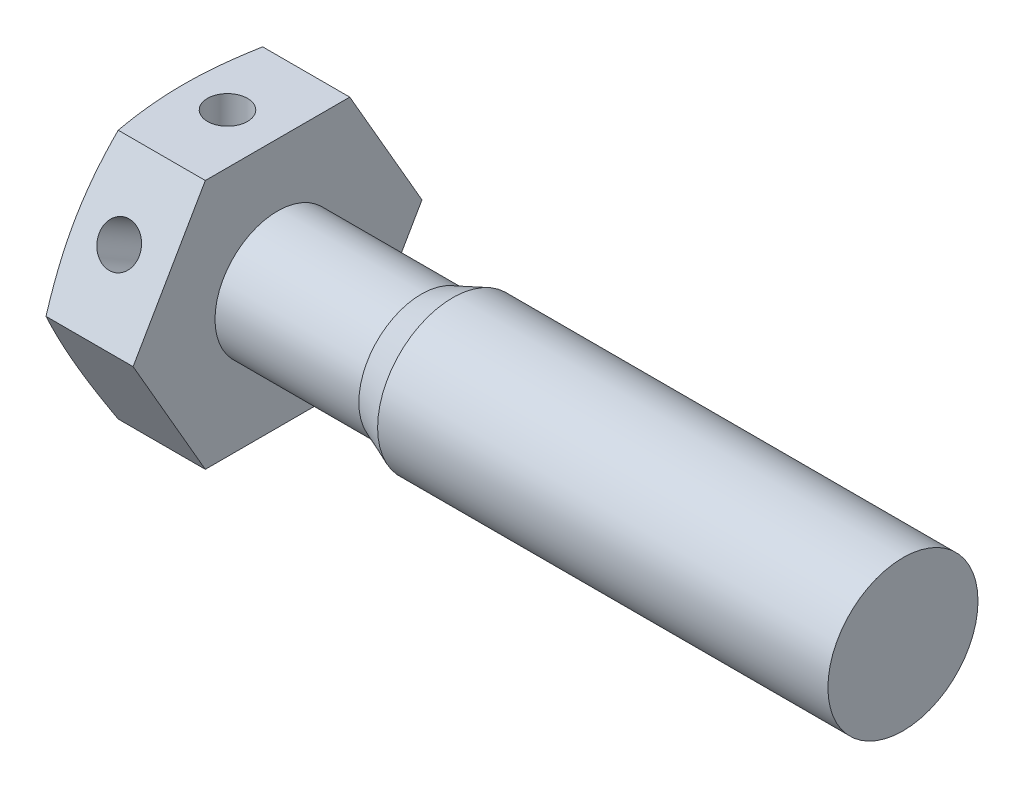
ISO-10303-21;
HEADER;
FILE_DESCRIPTION(('STEP AP214'),'2;1');
FILE_NAME('part.step','',(''),(''),'','','');
FILE_SCHEMA(('AUTOMOTIVE_DESIGN { 1 0 10303 214 1 1 1 1 }'));
ENDSEC;
DATA;
#1=APPLICATION_CONTEXT('core data for automotive mechanical design processes');
#2=APPLICATION_PROTOCOL_DEFINITION('international standard','automotive_design',2000,#1);
#3=PRODUCT_CONTEXT('',#1,'mechanical');
#4=PRODUCT('Part','Part','',(#3));
#5=PRODUCT_RELATED_PRODUCT_CATEGORY('part','',(#4));
#6=PRODUCT_DEFINITION_FORMATION('','',#4);
#7=PRODUCT_DEFINITION_CONTEXT('part definition',#1,'design');
#8=PRODUCT_DEFINITION('design','',#6,#7);
#9=PRODUCT_DEFINITION_SHAPE('','',#8);
#10=(LENGTH_UNIT() NAMED_UNIT(*) SI_UNIT(.MILLI.,.METRE.));
#11=(NAMED_UNIT(*) PLANE_ANGLE_UNIT() SI_UNIT($,.RADIAN.));
#12=(NAMED_UNIT(*) SI_UNIT($,.STERADIAN.) SOLID_ANGLE_UNIT());
#13=UNCERTAINTY_MEASURE_WITH_UNIT(LENGTH_MEASURE(1.E-05),#10,'distance_accuracy_value','');
#14=(GEOMETRIC_REPRESENTATION_CONTEXT(3) GLOBAL_UNCERTAINTY_ASSIGNED_CONTEXT((#13)) GLOBAL_UNIT_ASSIGNED_CONTEXT((#10,
#11,#12)) REPRESENTATION_CONTEXT('',''));
#15=CARTESIAN_POINT('',(0.,0.,0.));
#16=DIRECTION('',(0.,0.,1.));
#17=DIRECTION('',(1.,0.,0.));
#18=AXIS2_PLACEMENT_3D('',#15,#16,#17);
#19=CARTESIAN_POINT('',(2.,-5.,0.));
#20=DIRECTION('',(0.,1.,0.));
#21=DIRECTION('',(0.,0.,1.));
#22=AXIS2_PLACEMENT_3D('',#19,#20,#21);
#23=CYLINDRICAL_SURFACE('',#22,0.8);
#24=CARTESIAN_POINT('',(2.,5.00000000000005,0.));
#25=DIRECTION('',(0.,1.,0.));
#26=DIRECTION('',(0.,0.,1.));
#27=AXIS2_PLACEMENT_3D('',#24,#25,#26);
#28=CIRCLE('',#27,0.8);
#29=CARTESIAN_POINT('',(2.,5.00000000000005,0.8));
#30=VERTEX_POINT('',#29);
#31=EDGE_CURVE('E321',#30,#30,#28,.T.);
#32=ORIENTED_EDGE('',*,*,#31,.T.);
#33=EDGE_LOOP('',(#32));
#34=FACE_BOUND('',#33,.T.);
#35=CARTESIAN_POINT('',(2.,0.,0.));
#36=DIRECTION('',(0.,0.500000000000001,-0.866025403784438));
#37=DIRECTION('',(0.,0.866025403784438,0.500000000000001));
#38=AXIS2_PLACEMENT_3D('',#35,#36,#37);
#39=ELLIPSE('',#38,1.6,0.8);
#40=CARTESIAN_POINT('',(2.8,0.,0.));
#41=VERTEX_POINT('',#40);
#42=CARTESIAN_POINT('',(1.2,0.,0.));
#43=VERTEX_POINT('',#42);
#44=EDGE_CURVE('E51',#41,#43,#39,.F.);
#45=ORIENTED_EDGE('',*,*,#44,.T.);
#46=CARTESIAN_POINT('',(2.,0.,0.));
#47=DIRECTION('',(0.,0.866025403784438,0.500000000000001));
#48=DIRECTION('',(0.,0.500000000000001,-0.866025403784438));
#49=AXIS2_PLACEMENT_3D('',#46,#47,#48);
#50=ELLIPSE('',#49,0.923760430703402,0.8);
#51=EDGE_CURVE('E11',#43,#41,#50,.F.);
#52=ORIENTED_EDGE('',*,*,#51,.T.);
#53=EDGE_LOOP('',(#45,#52));
#54=FACE_BOUND('',#53,.T.);
#55=ADVANCED_FACE('F37',(#34,#54),#23,.F.);
#56=CARTESIAN_POINT('',(4.,-5.,-2.88675134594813));
#57=DIRECTION('',(0.,0.5,0.866025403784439));
#58=DIRECTION('',(0.,-0.866025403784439,0.5));
#59=AXIS2_PLACEMENT_3D('',#56,#57,#58);
#60=PLANE('',#59);
#61=CARTESIAN_POINT('',(2.,-2.49999999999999,-4.3301270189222));
#62=DIRECTION('',(0.,0.5,0.866025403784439));
#63=DIRECTION('',(0.,-0.866025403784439,0.5));
#64=AXIS2_PLACEMENT_3D('',#61,#62,#63);
#65=CIRCLE('',#64,0.8);
#66=CARTESIAN_POINT('',(2.,-3.19282032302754,-3.9301270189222));
#67=VERTEX_POINT('',#66);
#68=EDGE_CURVE('E325',#67,#67,#65,.T.);
#69=ORIENTED_EDGE('',*,*,#68,.T.);
#70=EDGE_LOOP('',(#69));
#71=FACE_BOUND('',#70,.T.);
#72=CARTESIAN_POINT('',(0.518154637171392,0.00019999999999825,-5.7736181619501));
#73=CARTESIAN_POINT('',(0.47462281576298,-0.206877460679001,-5.65406193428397));
#74=CARTESIAN_POINT('',(0.435023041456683,-0.41463778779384,-5.5341114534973));
#75=CARTESIAN_POINT('',(0.365353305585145,-0.831509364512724,-5.29343053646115));
#76=CARTESIAN_POINT('',(0.335290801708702,-1.04062154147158,-5.17269956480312));
#77=CARTESIAN_POINT('',(0.286665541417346,-1.45787607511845,-4.93179754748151));
#78=CARTESIAN_POINT('',(0.267996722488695,-1.66600890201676,-4.81163200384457));
#79=CARTESIAN_POINT('',(0.242956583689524,-2.08276129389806,-4.57101989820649));
#80=CARTESIAN_POINT('',(0.236580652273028,-2.29138064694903,-4.45057345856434));
#81=CARTESIAN_POINT('',(0.236580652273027,-2.70861935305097,-4.20968057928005));
#82=CARTESIAN_POINT('',(0.242956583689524,-2.91723870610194,-4.08923413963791));
#83=CARTESIAN_POINT('',(0.267996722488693,-3.33399109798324,-3.84862203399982));
#84=CARTESIAN_POINT('',(0.286665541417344,-3.54212392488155,-3.72845649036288));
#85=CARTESIAN_POINT('',(0.335290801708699,-3.95937845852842,-3.48755447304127));
#86=CARTESIAN_POINT('',(0.365353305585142,-4.16849063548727,-3.36682350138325));
#87=CARTESIAN_POINT('',(0.435023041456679,-4.58536221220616,-3.1261425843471));
#88=CARTESIAN_POINT('',(0.474622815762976,-4.793122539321,-3.00619210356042));
#89=CARTESIAN_POINT('',(0.518154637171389,-5.0002,-2.8866358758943));
#90=B_SPLINE_CURVE_WITH_KNOTS('',3,(#72,#73,#74,#75,#76,#77,#78,#79,#80,#81,#82,#83,#84,#85,#86,
#87,#88,#89),.UNSPECIFIED.,.F.,.F.,(4,2,2,2,2,2,2,2,4),(0.,0.729203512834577,1.45897583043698,
2.18184682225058,2.90444658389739,3.6270463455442,4.34991733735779,5.0796896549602,
5.80889316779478),.UNSPECIFIED.);
#91=CARTESIAN_POINT('',(0.518112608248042,0.,-5.77350269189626));
#92=VERTEX_POINT('',#91);
#93=CARTESIAN_POINT('',(0.518112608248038,-5.,-2.88675134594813));
#94=VERTEX_POINT('',#93);
#95=EDGE_CURVE('E59',#92,#94,#90,.T.);
#96=ORIENTED_EDGE('',*,*,#95,.F.);
#97=DIRECTION('',(-1.,0.,0.));
#98=VECTOR('',#97,1.);
#99=CARTESIAN_POINT('',(4.,0.,-5.77350269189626));
#100=LINE('',#99,#98);
#101=CARTESIAN_POINT('',(4.,0.,-5.77350269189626));
#102=VERTEX_POINT('',#101);
#103=EDGE_CURVE('E106',#102,#92,#100,.T.);
#104=ORIENTED_EDGE('',*,*,#103,.F.);
#105=DIRECTION('',(0.,0.866025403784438,-0.5));
#106=VECTOR('',#105,1.);
#107=CARTESIAN_POINT('',(4.,-5.,-2.88675134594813));
#108=LINE('',#107,#106);
#109=CARTESIAN_POINT('',(4.,-5.,-2.88675134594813));
#110=VERTEX_POINT('',#109);
#111=EDGE_CURVE('E138',#110,#102,#108,.T.);
#112=ORIENTED_EDGE('',*,*,#111,.F.);
#113=DIRECTION('',(-1.,0.,0.));
#114=VECTOR('',#113,1.);
#115=CARTESIAN_POINT('',(4.,-5.,-2.88675134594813));
#116=LINE('',#115,#114);
#117=EDGE_CURVE('E125',#110,#94,#116,.T.);
#118=ORIENTED_EDGE('',*,*,#117,.T.);
#119=EDGE_LOOP('',(#96,#104,#112,#118));
#120=FACE_BOUND('',#119,.T.);
#121=ADVANCED_FACE('F39',(#71,#120),#60,.F.);
#122=CARTESIAN_POINT('',(4.,0.,-5.77350269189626));
#123=DIRECTION('',(0.,-0.500000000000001,0.866025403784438));
#124=DIRECTION('',(0.,-0.866025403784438,-0.500000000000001));
#125=AXIS2_PLACEMENT_3D('',#122,#123,#124);
#126=PLANE('',#125);
#127=CARTESIAN_POINT('',(0.518154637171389,5.0002,-2.88663587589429));
#128=CARTESIAN_POINT('',(0.474622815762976,4.793122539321,-3.00619210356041));
#129=CARTESIAN_POINT('',(0.435023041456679,4.58536221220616,-3.12614258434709));
#130=CARTESIAN_POINT('',(0.365353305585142,4.16849063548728,-3.36682350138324));
#131=CARTESIAN_POINT('',(0.335290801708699,3.95937845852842,-3.48755447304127));
#132=CARTESIAN_POINT('',(0.286665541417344,3.54212392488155,-3.72845649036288));
#133=CARTESIAN_POINT('',(0.267996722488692,3.33399109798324,-3.84862203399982));
#134=CARTESIAN_POINT('',(0.242956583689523,2.91723870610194,-4.0892341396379));
#135=CARTESIAN_POINT('',(0.236580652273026,2.70861935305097,-4.20968057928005));
#136=CARTESIAN_POINT('',(0.236580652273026,2.29138064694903,-4.45057345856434));
#137=CARTESIAN_POINT('',(0.242956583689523,2.08276129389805,-4.57101989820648));
#138=CARTESIAN_POINT('',(0.267996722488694,1.66600890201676,-4.81163200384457));
#139=CARTESIAN_POINT('',(0.286665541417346,1.45787607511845,-4.93179754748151));
#140=CARTESIAN_POINT('',(0.335290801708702,1.04062154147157,-5.17269956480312));
#141=CARTESIAN_POINT('',(0.365353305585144,0.831509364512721,-5.29343053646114));
#142=CARTESIAN_POINT('',(0.435023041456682,0.414637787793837,-5.5341114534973));
#143=CARTESIAN_POINT('',(0.47462281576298,0.206877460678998,-5.65406193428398));
#144=CARTESIAN_POINT('',(0.518154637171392,-0.000200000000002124,-5.7736181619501));
#145=B_SPLINE_CURVE_WITH_KNOTS('',3,(#127,#128,#129,#130,#131,#132,#133,#134,#135,#136,#137,
#138,#139,#140,#141,#142,#143,#144),.UNSPECIFIED.,.F.,.F.,(4,2,2,2,2,2,2,2,4),(0.,
0.729203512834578,1.45897583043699,2.18184682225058,2.90444658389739,3.6270463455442,
4.3499173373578,5.07968965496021,5.80889316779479),.UNSPECIFIED.);
#146=CARTESIAN_POINT('',(0.518112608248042,5.,-2.88675134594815));
#147=VERTEX_POINT('',#146);
#148=EDGE_CURVE('E149',#147,#92,#145,.T.);
#149=ORIENTED_EDGE('',*,*,#148,.F.);
#150=DIRECTION('',(-1.,0.,0.));
#151=VECTOR('',#150,1.);
#152=CARTESIAN_POINT('',(4.,5.,-2.88675134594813));
#153=LINE('',#152,#151);
#154=CARTESIAN_POINT('',(4.,5.,-2.88675134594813));
#155=VERTEX_POINT('',#154);
#156=EDGE_CURVE('E113',#155,#147,#153,.T.);
#157=ORIENTED_EDGE('',*,*,#156,.F.);
#158=DIRECTION('',(0.,0.866025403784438,0.5));
#159=VECTOR('',#158,1.);
#160=CARTESIAN_POINT('',(4.,0.,-5.77350269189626));
#161=LINE('',#160,#159);
#162=EDGE_CURVE('E136',#102,#155,#161,.T.);
#163=ORIENTED_EDGE('',*,*,#162,.F.);
#164=ORIENTED_EDGE('',*,*,#103,.T.);
#165=EDGE_LOOP('',(#149,#157,#163,#164));
#166=FACE_BOUND('',#165,.T.);
#167=ADVANCED_FACE('F204',(#166),#126,.F.);
#168=CARTESIAN_POINT('',(4.,5.,-2.88675134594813));
#169=DIRECTION('',(0.,-1.,0.));
#170=DIRECTION('',(0.,0.,-1.));
#171=AXIS2_PLACEMENT_3D('',#168,#169,#170);
#172=PLANE('',#171);
#173=ORIENTED_EDGE('',*,*,#31,.F.);
#174=EDGE_LOOP('',(#173));
#175=FACE_BOUND('',#174,.T.);
#176=CARTESIAN_POINT('',(1.73412088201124,5.,-7.62058685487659));
#177=CARTESIAN_POINT('',(1.66536818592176,5.,-7.39459725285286));
#178=CARTESIAN_POINT('',(1.5974227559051,5.,-7.16835746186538));
#179=CARTESIAN_POINT('',(1.46359308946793,5.,-6.71525017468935));
#180=CARTESIAN_POINT('',(1.39770901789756,5.,-6.48838262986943));
#181=CARTESIAN_POINT('',(1.26833776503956,5.,-6.03349928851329));
#182=CARTESIAN_POINT('',(1.20485534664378,5.,-5.80548213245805));
#183=CARTESIAN_POINT('',(1.08103648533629,5.,-5.34859642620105));
#184=CARTESIAN_POINT('',(1.02069998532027,5.,-5.11972789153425));
#185=CARTESIAN_POINT('',(0.904681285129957,5.,-4.66385371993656));
#186=CARTESIAN_POINT('',(0.848950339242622,5.,-4.43686055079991));
#187=CARTESIAN_POINT('',(0.742270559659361,5.,-3.98175526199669));
#188=CARTESIAN_POINT('',(0.691321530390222,5.,-3.7536431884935));
#189=CARTESIAN_POINT('',(0.595395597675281,5.,-3.29623351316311));
#190=CARTESIAN_POINT('',(0.550416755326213,5.,-3.06693632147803));
#191=CARTESIAN_POINT('',(0.467808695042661,5.,-2.60701194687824));
#192=CARTESIAN_POINT('',(0.430179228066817,5.,-2.37638480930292));
#193=CARTESIAN_POINT('',(0.367531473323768,5.,-1.93980954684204));
#194=CARTESIAN_POINT('',(0.341571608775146,5.,-1.73399780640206));
#195=CARTESIAN_POINT('',(0.297702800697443,5.,-1.32151095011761));
#196=CARTESIAN_POINT('',(0.279793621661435,5.,-1.11483585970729));
#197=CARTESIAN_POINT('',(0.252888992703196,5.,-0.70104199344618));
#198=CARTESIAN_POINT('',(0.243887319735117,5.,-0.49392362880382));
#199=CARTESIAN_POINT('',(0.235252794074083,5.,-0.0794895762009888));
#200=CARTESIAN_POINT('',(0.235619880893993,5.,0.127826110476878));
#201=CARTESIAN_POINT('',(0.245728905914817,5.,0.543296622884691));
#202=CARTESIAN_POINT('',(0.255519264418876,5.,0.751450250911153));
#203=CARTESIAN_POINT('',(0.284025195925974,5.,1.16714016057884));
#204=CARTESIAN_POINT('',(0.302740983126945,5.,1.37467642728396));
#205=CARTESIAN_POINT('',(0.348227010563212,5.,1.78903168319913));
#206=CARTESIAN_POINT('',(0.375004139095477,5.,1.99584990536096));
#207=CARTESIAN_POINT('',(0.435533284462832,5.,2.40845147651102));
#208=CARTESIAN_POINT('',(0.469285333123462,5.,2.61423482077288));
#209=CARTESIAN_POINT('',(0.544976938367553,5.,3.03762754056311));
#210=CARTESIAN_POINT('',(0.587297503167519,5.,3.25516820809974));
#211=CARTESIAN_POINT('',(0.677388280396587,5.,3.68912540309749));
#212=CARTESIAN_POINT('',(0.725158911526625,5.,3.90554184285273));
#213=CARTESIAN_POINT('',(0.825138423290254,5.,4.33740834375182));
#214=CARTESIAN_POINT('',(0.877348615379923,5.,4.55285809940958));
#215=CARTESIAN_POINT('',(0.985352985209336,5.,4.98284735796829));
#216=CARTESIAN_POINT('',(1.04114707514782,5.,5.19738688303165));
#217=CARTESIAN_POINT('',(1.15571790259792,5.,5.62596240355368));
#218=CARTESIAN_POINT('',(1.21449840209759,5.,5.83999738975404));
#219=CARTESIAN_POINT('',(1.33444153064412,5.,6.26740010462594));
#220=CARTESIAN_POINT('',(1.395604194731,5.,6.48076782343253));
#221=CARTESIAN_POINT('',(1.5819781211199,5.,7.11994374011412));
#222=CARTESIAN_POINT('',(1.71009677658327,5.,7.54490360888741));
#223=CARTESIAN_POINT('',(1.97013168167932,5.,8.38829124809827));
#224=CARTESIAN_POINT('',(2.10198722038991,5.,8.80673789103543));
#225=CARTESIAN_POINT('',(2.3694113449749,5.,9.64246317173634));
#226=CARTESIAN_POINT('',(2.50498011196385,5.,10.0597417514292));
#227=CARTESIAN_POINT('',(2.77829656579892,5.,10.891820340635));
#228=CARTESIAN_POINT('',(2.91603397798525,5.,11.3066237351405));
#229=CARTESIAN_POINT('',(3.19355173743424,5.,12.1355089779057));
#230=CARTESIAN_POINT('',(3.33333191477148,5.,12.5495908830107));
#231=CARTESIAN_POINT('',(3.47382628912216,5.,12.9634270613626));
#232=B_SPLINE_CURVE_WITH_KNOTS('',3,(#176,#177,#178,#179,#180,#181,#182,#183,#184,#185,#186,
#187,#188,#189,#190,#191,#192,#193,#194,#195,#196,#197,#198,#199,#200,#201,#202,#203,#204,#205,
#206,#207,#208,#209,#210,#211,#212,#213,#214,#215,#216,#217,#218,#219,#220,#221,#222,#223,#224,
#225,#226,#227,#228,#229,#230,#231),.UNSPECIFIED.,.F.,.F.,(4,2,2,2,2,2,2,2,2,2,2,2,2,2,2,2,2,2,
2,2,2,2,2,2,2,2,2,4),(0.,0.708654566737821,1.4173656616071,2.1274155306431,2.83745250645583,
3.53861525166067,4.23974930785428,4.94065510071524,5.64153713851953,6.26372739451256,
6.8858994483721,7.50763652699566,8.12936959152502,8.75431450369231,9.37927441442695,
10.0047698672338,10.6302681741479,11.2950391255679,11.9598611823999,12.6248803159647,
13.2898831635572,13.9557455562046,14.6216177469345,15.9531168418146,17.269284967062,
18.585517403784,19.8967329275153,21.2078399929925),.UNSPECIFIED.);
#233=CARTESIAN_POINT('',(0.518112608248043,5.00000000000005,2.8867513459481));
#234=VERTEX_POINT('',#233);
#235=EDGE_CURVE('E194',#234,#147,#232,.F.);
#236=ORIENTED_EDGE('',*,*,#235,.F.);
#237=DIRECTION('',(-1.,0.,0.));
#238=VECTOR('',#237,1.);
#239=CARTESIAN_POINT('',(4.,5.,2.88675134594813));
#240=LINE('',#239,#238);
#241=CARTESIAN_POINT('',(4.,5.,2.88675134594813));
#242=VERTEX_POINT('',#241);
#243=EDGE_CURVE('E116',#242,#234,#240,.T.);
#244=ORIENTED_EDGE('',*,*,#243,.F.);
#245=DIRECTION('',(0.,0.,1.));
#246=VECTOR('',#245,1.);
#247=CARTESIAN_POINT('',(4.,5.,-2.88675134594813));
#248=LINE('',#247,#246);
#249=EDGE_CURVE('E134',#155,#242,#248,.T.);
#250=ORIENTED_EDGE('',*,*,#249,.F.);
#251=ORIENTED_EDGE('',*,*,#156,.T.);
#252=EDGE_LOOP('',(#236,#244,#250,#251));
#253=FACE_BOUND('',#252,.T.);
#254=ADVANCED_FACE('F200',(#175,#253),#172,.F.);
#255=CARTESIAN_POINT('',(4.,5.,2.88675134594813));
#256=DIRECTION('',(0.,-0.5,-0.866025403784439));
#257=DIRECTION('',(0.,0.866025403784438,-0.5));
#258=AXIS2_PLACEMENT_3D('',#255,#256,#257);
#259=PLANE('',#258);
#260=CARTESIAN_POINT('',(2.,2.49999999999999,4.3301270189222));
#261=DIRECTION('',(0.,-0.5,-0.866025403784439));
#262=DIRECTION('',(0.,0.866025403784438,-0.5));
#263=AXIS2_PLACEMENT_3D('',#260,#261,#262);
#264=CIRCLE('',#263,0.8);
#265=CARTESIAN_POINT('',(2.,3.19282032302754,3.9301270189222));
#266=VERTEX_POINT('',#265);
#267=EDGE_CURVE('E328',#266,#266,#264,.T.);
#268=ORIENTED_EDGE('',*,*,#267,.T.);
#269=EDGE_LOOP('',(#268));
#270=FACE_BOUND('',#269,.T.);
#271=CARTESIAN_POINT('',(0.518154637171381,-0.000199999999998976,5.7736181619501));
#272=CARTESIAN_POINT('',(0.474622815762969,0.206877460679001,5.65406193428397));
#273=CARTESIAN_POINT('',(0.435023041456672,0.41463778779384,5.5341114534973));
#274=CARTESIAN_POINT('',(0.365353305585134,0.831509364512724,5.29343053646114));
#275=CARTESIAN_POINT('',(0.335290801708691,1.04062154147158,5.17269956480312));
#276=CARTESIAN_POINT('',(0.286665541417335,1.45787607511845,4.93179754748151));
#277=CARTESIAN_POINT('',(0.267996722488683,1.66600890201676,4.81163200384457));
#278=CARTESIAN_POINT('',(0.242956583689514,2.08276129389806,4.57101989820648));
#279=CARTESIAN_POINT('',(0.236580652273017,2.29138064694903,4.45057345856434));
#280=CARTESIAN_POINT('',(0.236580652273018,2.70861935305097,4.20968057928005));
#281=CARTESIAN_POINT('',(0.242956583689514,2.91723870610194,4.08923413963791));
#282=CARTESIAN_POINT('',(0.267996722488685,3.33399109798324,3.84862203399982));
#283=CARTESIAN_POINT('',(0.286665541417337,3.54212392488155,3.72845649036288));
#284=CARTESIAN_POINT('',(0.335290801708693,3.95937845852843,3.48755447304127));
#285=CARTESIAN_POINT('',(0.365353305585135,4.16849063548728,3.36682350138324));
#286=CARTESIAN_POINT('',(0.435023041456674,4.58536221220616,3.12614258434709));
#287=CARTESIAN_POINT('',(0.474622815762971,4.793122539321,3.00619210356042));
#288=CARTESIAN_POINT('',(0.518154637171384,5.0002,2.88663587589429));
#289=B_SPLINE_CURVE_WITH_KNOTS('',3,(#271,#272,#273,#274,#275,#276,#277,#278,#279,#280,#281,
#282,#283,#284,#285,#286,#287,#288),.UNSPECIFIED.,.F.,.F.,(4,2,2,2,2,2,2,2,4),(0.,
0.729203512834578,1.45897583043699,2.18184682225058,2.90444658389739,3.6270463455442,
4.3499173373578,5.07968965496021,5.80889316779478),.UNSPECIFIED.);
#290=CARTESIAN_POINT('',(0.518112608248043,0.,5.77350269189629));
#291=VERTEX_POINT('',#290);
#292=EDGE_CURVE('E188',#291,#234,#289,.T.);
#293=ORIENTED_EDGE('',*,*,#292,.F.);
#294=DIRECTION('',(-1.,0.,0.));
#295=VECTOR('',#294,1.);
#296=CARTESIAN_POINT('',(4.,0.,5.77350269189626));
#297=LINE('',#296,#295);
#298=CARTESIAN_POINT('',(4.,0.,5.77350269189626));
#299=VERTEX_POINT('',#298);
#300=EDGE_CURVE('E119',#299,#291,#297,.T.);
#301=ORIENTED_EDGE('',*,*,#300,.F.);
#302=DIRECTION('',(0.,-0.866025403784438,0.5));
#303=VECTOR('',#302,1.);
#304=CARTESIAN_POINT('',(4.,5.,2.88675134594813));
#305=LINE('',#304,#303);
#306=EDGE_CURVE('E132',#242,#299,#305,.T.);
#307=ORIENTED_EDGE('',*,*,#306,.F.);
#308=ORIENTED_EDGE('',*,*,#243,.T.);
#309=EDGE_LOOP('',(#293,#301,#307,#308));
#310=FACE_BOUND('',#309,.T.);
#311=ADVANCED_FACE('F203',(#270,#310),#259,.F.);
#312=CARTESIAN_POINT('',(4.,0.,5.77350269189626));
#313=DIRECTION('',(0.,0.500000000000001,-0.866025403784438));
#314=DIRECTION('',(0.,0.866025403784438,0.500000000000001));
#315=AXIS2_PLACEMENT_3D('',#312,#313,#314);
#316=PLANE('',#315);
#317=CARTESIAN_POINT('',(0.518154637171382,-5.0002,2.88663587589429));
#318=CARTESIAN_POINT('',(0.474622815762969,-4.793122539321,3.00619210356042));
#319=CARTESIAN_POINT('',(0.435023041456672,-4.58536221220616,3.12614258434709));
#320=CARTESIAN_POINT('',(0.365353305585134,-4.16849063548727,3.36682350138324));
#321=CARTESIAN_POINT('',(0.335290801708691,-3.95937845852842,3.48755447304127));
#322=CARTESIAN_POINT('',(0.286665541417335,-3.54212392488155,3.72845649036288));
#323=CARTESIAN_POINT('',(0.267996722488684,-3.33399109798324,3.84862203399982));
#324=CARTESIAN_POINT('',(0.242956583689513,-2.91723870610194,4.08923413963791));
#325=CARTESIAN_POINT('',(0.236580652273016,-2.70861935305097,4.20968057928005));
#326=CARTESIAN_POINT('',(0.236580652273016,-2.29138064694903,4.45057345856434));
#327=CARTESIAN_POINT('',(0.242956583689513,-2.08276129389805,4.57101989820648));
#328=CARTESIAN_POINT('',(0.267996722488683,-1.66600890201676,4.81163200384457));
#329=CARTESIAN_POINT('',(0.286665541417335,-1.45787607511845,4.93179754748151));
#330=CARTESIAN_POINT('',(0.335290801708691,-1.04062154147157,5.17269956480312));
#331=CARTESIAN_POINT('',(0.365353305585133,-0.83150936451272,5.29343053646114));
#332=CARTESIAN_POINT('',(0.435023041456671,-0.414637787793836,5.5341114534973));
#333=CARTESIAN_POINT('',(0.474622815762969,-0.206877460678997,5.65406193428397));
#334=CARTESIAN_POINT('',(0.518154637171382,0.000200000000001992,5.7736181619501));
#335=B_SPLINE_CURVE_WITH_KNOTS('',3,(#317,#318,#319,#320,#321,#322,#323,#324,#325,#326,#327,
#328,#329,#330,#331,#332,#333,#334),.UNSPECIFIED.,.F.,.F.,(4,2,2,2,2,2,2,2,4),(0.,
0.729203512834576,1.45897583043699,2.18184682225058,2.90444658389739,3.6270463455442,
4.3499173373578,5.0796896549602,5.80889316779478),.UNSPECIFIED.);
#336=CARTESIAN_POINT('',(0.518112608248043,-4.99999999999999,2.88675134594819));
#337=VERTEX_POINT('',#336);
#338=EDGE_CURVE('E180',#337,#291,#335,.T.);
#339=ORIENTED_EDGE('',*,*,#338,.F.);
#340=DIRECTION('',(-1.,0.,0.));
#341=VECTOR('',#340,1.);
#342=CARTESIAN_POINT('',(4.,-5.,2.88675134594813));
#343=LINE('',#342,#341);
#344=CARTESIAN_POINT('',(4.,-5.,2.88675134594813));
#345=VERTEX_POINT('',#344);
#346=EDGE_CURVE('E122',#345,#337,#343,.T.);
#347=ORIENTED_EDGE('',*,*,#346,.F.);
#348=DIRECTION('',(0.,-0.866025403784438,-0.500000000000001));
#349=VECTOR('',#348,1.);
#350=CARTESIAN_POINT('',(4.,0.,5.77350269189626));
#351=LINE('',#350,#349);
#352=EDGE_CURVE('E130',#299,#345,#351,.T.);
#353=ORIENTED_EDGE('',*,*,#352,.F.);
#354=ORIENTED_EDGE('',*,*,#300,.T.);
#355=EDGE_LOOP('',(#339,#347,#353,#354));
#356=FACE_BOUND('',#355,.T.);
#357=ADVANCED_FACE('F246',(#356),#316,.F.);
#358=CARTESIAN_POINT('',(4.,-5.,2.88675134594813));
#359=DIRECTION('',(0.,1.,0.));
#360=DIRECTION('',(0.,0.,1.));
#361=AXIS2_PLACEMENT_3D('',#358,#359,#360);
#362=PLANE('',#361);
#363=CARTESIAN_POINT('',(2.,-5.,0.));
#364=DIRECTION('',(0.,1.,0.));
#365=DIRECTION('',(0.,0.,1.));
#366=AXIS2_PLACEMENT_3D('',#363,#364,#365);
#367=CIRCLE('',#366,0.8);
#368=CARTESIAN_POINT('',(2.,-5.,0.8));
#369=VERTEX_POINT('',#368);
#370=EDGE_CURVE('E319',#369,#369,#367,.T.);
#371=ORIENTED_EDGE('',*,*,#370,.T.);
#372=EDGE_LOOP('',(#371));
#373=FACE_BOUND('',#372,.T.);
#374=CARTESIAN_POINT('',(1.73412088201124,-5.,-7.6205868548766));
#375=CARTESIAN_POINT('',(1.66536818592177,-5.,-7.39459725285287));
#376=CARTESIAN_POINT('',(1.5974227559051,-5.,-7.16835746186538));
#377=CARTESIAN_POINT('',(1.46359308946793,-5.,-6.71525017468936));
#378=CARTESIAN_POINT('',(1.39770901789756,-5.,-6.48838262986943));
#379=CARTESIAN_POINT('',(1.26833776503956,-5.,-6.03349928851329));
#380=CARTESIAN_POINT('',(1.20485534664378,-5.,-5.80548213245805));
#381=CARTESIAN_POINT('',(1.08103648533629,-5.,-5.34859642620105));
#382=CARTESIAN_POINT('',(1.02069998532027,-5.,-5.11972789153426));
#383=CARTESIAN_POINT('',(0.904681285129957,-5.,-4.66385371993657));
#384=CARTESIAN_POINT('',(0.848950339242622,-5.,-4.43686055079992));
#385=CARTESIAN_POINT('',(0.742270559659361,-5.,-3.9817552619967));
#386=CARTESIAN_POINT('',(0.691321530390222,-5.,-3.7536431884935));
#387=CARTESIAN_POINT('',(0.595395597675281,-5.,-3.29623351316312));
#388=CARTESIAN_POINT('',(0.550416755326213,-5.,-3.06693632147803));
#389=CARTESIAN_POINT('',(0.46780869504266,-5.,-2.60701194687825));
#390=CARTESIAN_POINT('',(0.430179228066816,-5.,-2.37638480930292));
#391=CARTESIAN_POINT('',(0.367531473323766,-5.,-1.93980954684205));
#392=CARTESIAN_POINT('',(0.341571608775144,-5.,-1.73399780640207));
#393=CARTESIAN_POINT('',(0.297702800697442,-5.,-1.32151095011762));
#394=CARTESIAN_POINT('',(0.279793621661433,-5.,-1.11483585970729));
#395=CARTESIAN_POINT('',(0.252888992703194,-5.,-0.701041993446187));
#396=CARTESIAN_POINT('',(0.243887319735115,-5.,-0.493923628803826));
#397=CARTESIAN_POINT('',(0.235252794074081,-5.,-0.0794895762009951));
#398=CARTESIAN_POINT('',(0.235619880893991,-5.,0.127826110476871));
#399=CARTESIAN_POINT('',(0.245728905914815,-5.,0.543296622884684));
#400=CARTESIAN_POINT('',(0.255519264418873,-5.,0.751450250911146));
#401=CARTESIAN_POINT('',(0.284025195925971,-5.,1.16714016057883));
#402=CARTESIAN_POINT('',(0.302740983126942,-5.,1.37467642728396));
#403=CARTESIAN_POINT('',(0.348227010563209,-5.,1.78903168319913));
#404=CARTESIAN_POINT('',(0.375004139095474,-5.,1.99584990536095));
#405=CARTESIAN_POINT('',(0.435533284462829,-5.,2.40845147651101));
#406=CARTESIAN_POINT('',(0.469285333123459,-5.,2.61423482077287));
#407=CARTESIAN_POINT('',(0.54497693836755,-5.,3.0376275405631));
#408=CARTESIAN_POINT('',(0.587297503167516,-5.,3.25516820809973));
#409=CARTESIAN_POINT('',(0.677388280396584,-5.,3.68912540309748));
#410=CARTESIAN_POINT('',(0.725158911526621,-5.,3.90554184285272));
#411=CARTESIAN_POINT('',(0.825138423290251,-5.,4.33740834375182));
#412=CARTESIAN_POINT('',(0.87734861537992,-5.,4.55285809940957));
#413=CARTESIAN_POINT('',(0.985352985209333,-5.,4.98284735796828));
#414=CARTESIAN_POINT('',(1.04114707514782,-5.,5.19738688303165));
#415=CARTESIAN_POINT('',(1.15571790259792,-5.,5.62596240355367));
#416=CARTESIAN_POINT('',(1.21449840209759,-4.99999999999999,5.83999738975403));
#417=CARTESIAN_POINT('',(1.33444153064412,-4.99999999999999,6.26740010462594));
#418=CARTESIAN_POINT('',(1.39560419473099,-4.99999999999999,6.48076782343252));
#419=CARTESIAN_POINT('',(1.5819781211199,-4.99999999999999,7.11994374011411));
#420=CARTESIAN_POINT('',(1.71009677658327,-4.99999999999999,7.5449036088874));
#421=CARTESIAN_POINT('',(1.97013168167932,-4.99999999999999,8.38829124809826));
#422=CARTESIAN_POINT('',(2.10198722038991,-4.99999999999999,8.80673789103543));
#423=CARTESIAN_POINT('',(2.36941134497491,-4.99999999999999,9.64246317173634));
#424=CARTESIAN_POINT('',(2.50498011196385,-4.99999999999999,10.0597417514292));
#425=CARTESIAN_POINT('',(2.77829656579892,-4.99999999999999,10.891820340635));
#426=CARTESIAN_POINT('',(2.91603397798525,-4.99999999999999,11.3066237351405));
#427=CARTESIAN_POINT('',(3.19355173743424,-4.99999999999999,12.1355089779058));
#428=CARTESIAN_POINT('',(3.33333191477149,-4.99999999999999,12.5495908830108));
#429=CARTESIAN_POINT('',(3.47382628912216,-4.99999999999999,12.9634270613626));
#430=B_SPLINE_CURVE_WITH_KNOTS('',3,(#374,#375,#376,#377,#378,#379,#380,#381,#382,#383,#384,
#385,#386,#387,#388,#389,#390,#391,#392,#393,#394,#395,#396,#397,#398,#399,#400,#401,#402,#403,
#404,#405,#406,#407,#408,#409,#410,#411,#412,#413,#414,#415,#416,#417,#418,#419,#420,#421,#422,
#423,#424,#425,#426,#427,#428,#429),.UNSPECIFIED.,.F.,.F.,(4,2,2,2,2,2,2,2,2,2,2,2,2,2,2,2,2,2,
2,2,2,2,2,2,2,2,2,4),(0.,0.708654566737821,1.4173656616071,2.1274155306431,2.83745250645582,
3.53861525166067,4.23974930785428,4.94065510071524,5.64153713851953,6.26372739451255,
6.88589944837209,7.50763652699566,8.12936959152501,8.75431450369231,9.37927441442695,
10.0047698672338,10.6302681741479,11.2950391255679,11.9598611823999,12.6248803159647,
13.2898831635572,13.9557455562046,14.6216177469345,15.9531168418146,17.269284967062,
18.585517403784,19.8967329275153,21.2078399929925),.UNSPECIFIED.);
#431=EDGE_CURVE('E170',#94,#337,#430,.T.);
#432=ORIENTED_EDGE('',*,*,#431,.F.);
#433=ORIENTED_EDGE('',*,*,#117,.F.);
#434=DIRECTION('',(0.,0.,-1.));
#435=VECTOR('',#434,1.);
#436=CARTESIAN_POINT('',(4.,-5.,2.88675134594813));
#437=LINE('',#436,#435);
#438=EDGE_CURVE('E128',#345,#110,#437,.T.);
#439=ORIENTED_EDGE('',*,*,#438,.F.);
#440=ORIENTED_EDGE('',*,*,#346,.T.);
#441=EDGE_LOOP('',(#432,#433,#439,#440));
#442=FACE_BOUND('',#441,.T.);
#443=ADVANCED_FACE('F240',(#373,#442),#362,.F.);
#444=CARTESIAN_POINT('',(4.,0.,-5.77350269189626));
#445=DIRECTION('',(1.,0.,0.));
#446=DIRECTION('',(0.,0.,-1.));
#447=AXIS2_PLACEMENT_3D('',#444,#445,#446);
#448=PLANE('',#447);
#449=ORIENTED_EDGE('',*,*,#438,.T.);
#450=ORIENTED_EDGE('',*,*,#111,.T.);
#451=ORIENTED_EDGE('',*,*,#162,.T.);
#452=ORIENTED_EDGE('',*,*,#249,.T.);
#453=ORIENTED_EDGE('',*,*,#306,.T.);
#454=ORIENTED_EDGE('',*,*,#352,.T.);
#455=EDGE_LOOP('',(#449,#450,#451,#452,#453,#454));
#456=FACE_BOUND('',#455,.T.);
#457=CARTESIAN_POINT('',(4.,0.,0.));
#458=DIRECTION('',(-1.,0.,0.));
#459=DIRECTION('',(0.,0.,1.));
#460=AXIS2_PLACEMENT_3D('',#457,#458,#459);
#461=CIRCLE('',#460,2.5);
#462=CARTESIAN_POINT('',(4.,0.,2.5));
#463=VERTEX_POINT('',#462);
#464=EDGE_CURVE('E277',#463,#463,#461,.T.);
#465=ORIENTED_EDGE('',*,*,#464,.T.);
#466=EDGE_LOOP('',(#465));
#467=FACE_BOUND('',#466,.T.);
#468=ADVANCED_FACE('F161',(#456,#467),#448,.T.);
#469=CARTESIAN_POINT('',(0.,0.,0.));
#470=DIRECTION('',(1.,0.,0.));
#471=DIRECTION('',(0.,0.,-1.));
#472=AXIS2_PLACEMENT_3D('',#469,#470,#471);
#473=CONICAL_SURFACE('',#472,4.35000000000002,1.22173047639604);
#474=CARTESIAN_POINT('',(0.,0.,0.));
#475=DIRECTION('',(-1.,0.,0.));
#476=DIRECTION('',(0.,0.,1.));
#477=AXIS2_PLACEMENT_3D('',#474,#475,#476);
#478=CIRCLE('',#477,4.35000000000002);
#479=CARTESIAN_POINT('',(0.,0.,4.35000000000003));
#480=VERTEX_POINT('',#479);
#481=EDGE_CURVE('E291',#480,#480,#478,.T.);
#482=ORIENTED_EDGE('',*,*,#481,.F.);
#483=EDGE_LOOP('',(#482));
#484=FACE_BOUND('',#483,.T.);
#485=ORIENTED_EDGE('',*,*,#95,.T.);
#486=ORIENTED_EDGE('',*,*,#431,.T.);
#487=ORIENTED_EDGE('',*,*,#338,.T.);
#488=ORIENTED_EDGE('',*,*,#292,.T.);
#489=ORIENTED_EDGE('',*,*,#235,.T.);
#490=ORIENTED_EDGE('',*,*,#148,.T.);
#491=EDGE_LOOP('',(#485,#486,#487,#488,#489,#490));
#492=FACE_BOUND('',#491,.T.);
#493=ADVANCED_FACE('F155',(#484,#492),#473,.T.);
#494=CARTESIAN_POINT('',(0.,0.,-5.77350269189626));
#495=DIRECTION('',(1.,0.,0.));
#496=DIRECTION('',(0.,0.,-1.));
#497=AXIS2_PLACEMENT_3D('',#494,#495,#496);
#498=PLANE('',#497);
#499=CARTESIAN_POINT('',(0.,0.,0.));
#500=DIRECTION('',(-1.,0.,0.));
#501=DIRECTION('',(0.,0.,1.));
#502=AXIS2_PLACEMENT_3D('',#499,#500,#501);
#503=CIRCLE('',#502,3.4);
#504=CARTESIAN_POINT('',(0.,0.,3.4));
#505=VERTEX_POINT('',#504);
#506=EDGE_CURVE('E279',#505,#505,#503,.T.);
#507=ORIENTED_EDGE('',*,*,#506,.F.);
#508=EDGE_LOOP('',(#507));
#509=FACE_BOUND('',#508,.T.);
#510=ORIENTED_EDGE('',*,*,#481,.T.);
#511=EDGE_LOOP('',(#510));
#512=FACE_BOUND('',#511,.T.);
#513=ADVANCED_FACE('F160',(#509,#512),#498,.F.);
#514=CARTESIAN_POINT('',(0.8,0.,0.));
#515=DIRECTION('',(-1.,0.,0.));
#516=DIRECTION('',(0.,0.,1.));
#517=AXIS2_PLACEMENT_3D('',#514,#515,#516);
#518=CYLINDRICAL_SURFACE('',#517,3.4);
#519=CARTESIAN_POINT('',(0.8,0.,0.));
#520=DIRECTION('',(-1.,0.,0.));
#521=DIRECTION('',(0.,0.,1.));
#522=AXIS2_PLACEMENT_3D('',#519,#520,#521);
#523=CIRCLE('',#522,3.4);
#524=CARTESIAN_POINT('',(0.8,0.,3.4));
#525=VERTEX_POINT('',#524);
#526=EDGE_CURVE('E283',#525,#525,#523,.T.);
#527=ORIENTED_EDGE('',*,*,#526,.F.);
#528=EDGE_LOOP('',(#527));
#529=FACE_BOUND('',#528,.T.);
#530=ORIENTED_EDGE('',*,*,#506,.T.);
#531=EDGE_LOOP('',(#530));
#532=FACE_BOUND('',#531,.T.);
#533=ADVANCED_FACE('F163',(#529,#532),#518,.F.);
#534=CARTESIAN_POINT('',(0.8,0.,0.));
#535=DIRECTION('',(-1.,0.,0.));
#536=DIRECTION('',(0.,0.,1.));
#537=AXIS2_PLACEMENT_3D('',#534,#535,#536);
#538=PLANE('',#537);
#539=ORIENTED_EDGE('',*,*,#526,.T.);
#540=EDGE_LOOP('',(#539));
#541=FACE_BOUND('',#540,.T.);
#542=ADVANCED_FACE('F297',(#541),#538,.T.);
#543=CARTESIAN_POINT('',(-2.69717570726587,0.,0.));
#544=DIRECTION('',(-1.,0.,0.));
#545=DIRECTION('',(0.,0.,1.));
#546=AXIS2_PLACEMENT_3D('',#543,#544,#545);
#547=CYLINDRICAL_SURFACE('',#546,2.5);
#548=CARTESIAN_POINT('',(9.75,0.,0.));
#549=DIRECTION('',(-1.,0.,0.));
#550=DIRECTION('',(0.,0.,1.));
#551=AXIS2_PLACEMENT_3D('',#548,#549,#550);
#552=CIRCLE('',#551,2.5);
#553=CARTESIAN_POINT('',(9.75,0.,2.5));
#554=VERTEX_POINT('',#553);
#555=EDGE_CURVE('E280',#554,#554,#552,.T.);
#556=ORIENTED_EDGE('',*,*,#555,.T.);
#557=EDGE_LOOP('',(#556));
#558=FACE_BOUND('',#557,.T.);
#559=ORIENTED_EDGE('',*,*,#464,.F.);
#560=EDGE_LOOP('',(#559));
#561=FACE_BOUND('',#560,.T.);
#562=ADVANCED_FACE('F305',(#558,#561),#547,.T.);
#563=CARTESIAN_POINT('',(9.75,0.,0.));
#564=DIRECTION('',(1.,0.,0.));
#565=DIRECTION('',(0.,0.,-1.));
#566=AXIS2_PLACEMENT_3D('',#563,#564,#565);
#567=CONICAL_SURFACE('',#566,2.5,0.380506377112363);
#568=CARTESIAN_POINT('',(11.,0.,0.));
#569=DIRECTION('',(-1.,0.,0.));
#570=DIRECTION('',(0.,0.,1.));
#571=AXIS2_PLACEMENT_3D('',#568,#569,#570);
#572=CIRCLE('',#571,3.);
#573=CARTESIAN_POINT('',(11.,0.,3.));
#574=VERTEX_POINT('',#573);
#575=EDGE_CURVE('E286',#574,#574,#572,.T.);
#576=ORIENTED_EDGE('',*,*,#575,.T.);
#577=EDGE_LOOP('',(#576));
#578=FACE_BOUND('',#577,.T.);
#579=ORIENTED_EDGE('',*,*,#555,.F.);
#580=EDGE_LOOP('',(#579));
#581=FACE_BOUND('',#580,.T.);
#582=ADVANCED_FACE('F233',(#578,#581),#567,.T.);
#583=CARTESIAN_POINT('',(29.,0.,0.));
#584=DIRECTION('',(1.,0.,0.));
#585=DIRECTION('',(0.,0.,-1.));
#586=AXIS2_PLACEMENT_3D('',#583,#584,#585);
#587=PLANE('',#586);
#588=CARTESIAN_POINT('',(29.,0.,0.));
#589=DIRECTION('',(1.,0.,0.));
#590=DIRECTION('',(0.,0.,-1.));
#591=AXIS2_PLACEMENT_3D('',#588,#589,#590);
#592=CIRCLE('',#591,3.);
#593=CARTESIAN_POINT('',(29.,0.,-3.));
#594=VERTEX_POINT('',#593);
#595=EDGE_CURVE('E140',#594,#594,#592,.T.);
#596=ORIENTED_EDGE('',*,*,#595,.T.);
#597=EDGE_LOOP('',(#596));
#598=FACE_BOUND('',#597,.T.);
#599=ADVANCED_FACE('F165',(#598),#587,.T.);
#600=CARTESIAN_POINT('',(29.,0.,0.));
#601=DIRECTION('',(-1.,0.,0.));
#602=DIRECTION('',(0.,0.,1.));
#603=AXIS2_PLACEMENT_3D('',#600,#601,#602);
#604=CYLINDRICAL_SURFACE('',#603,3.);
#605=ORIENTED_EDGE('',*,*,#595,.F.);
#606=EDGE_LOOP('',(#605));
#607=FACE_BOUND('',#606,.T.);
#608=ORIENTED_EDGE('',*,*,#575,.F.);
#609=EDGE_LOOP('',(#608));
#610=FACE_BOUND('',#609,.T.);
#611=ADVANCED_FACE('F224',(#607,#610),#604,.T.);
#612=CARTESIAN_POINT('',(2.,0.,0.));
#613=DIRECTION('',(0.,0.500000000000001,-0.866025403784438));
#614=DIRECTION('',(0.,0.866025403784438,0.500000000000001));
#615=AXIS2_PLACEMENT_3D('',#612,#613,#614);
#616=ELLIPSE('',#615,1.6,0.8);
#617=EDGE_CURVE('E97',#41,#43,#616,.T.);
#618=ORIENTED_EDGE('',*,*,#617,.T.);
#619=CARTESIAN_POINT('',(2.,0.,0.));
#620=DIRECTION('',(0.,0.866025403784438,0.500000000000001));
#621=DIRECTION('',(0.,0.500000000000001,-0.866025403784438));
#622=AXIS2_PLACEMENT_3D('',#619,#620,#621);
#623=ELLIPSE('',#622,0.923760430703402,0.8);
#624=EDGE_CURVE('E46',#43,#41,#623,.T.);
#625=ORIENTED_EDGE('',*,*,#624,.T.);
#626=EDGE_LOOP('',(#618,#625));
#627=FACE_BOUND('',#626,.T.);
#628=ORIENTED_EDGE('',*,*,#370,.F.);
#629=EDGE_LOOP('',(#628));
#630=FACE_BOUND('',#629,.T.);
#631=ADVANCED_FACE('F108',(#627,#630),#23,.F.);
#632=CARTESIAN_POINT('',(2.,-3.74999999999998,-6.4951905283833));
#633=DIRECTION('',(0.,0.499999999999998,0.86602540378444));
#634=DIRECTION('',(0.,-0.86602540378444,0.499999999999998));
#635=AXIS2_PLACEMENT_3D('',#632,#633,#634);
#636=CYLINDRICAL_SURFACE('',#635,0.8);
#637=ORIENTED_EDGE('',*,*,#44,.F.);
#638=ORIENTED_EDGE('',*,*,#624,.F.);
#639=EDGE_LOOP('',(#637,#638));
#640=FACE_BOUND('',#639,.T.);
#641=ORIENTED_EDGE('',*,*,#267,.F.);
#642=EDGE_LOOP('',(#641));
#643=FACE_BOUND('',#642,.T.);
#644=ADVANCED_FACE('F104',(#640,#643),#636,.F.);
#645=ORIENTED_EDGE('',*,*,#617,.F.);
#646=ORIENTED_EDGE('',*,*,#51,.F.);
#647=EDGE_LOOP('',(#645,#646));
#648=FACE_BOUND('',#647,.T.);
#649=ORIENTED_EDGE('',*,*,#68,.F.);
#650=EDGE_LOOP('',(#649));
#651=FACE_BOUND('',#650,.T.);
#652=ADVANCED_FACE('F98',(#648,#651),#636,.F.);
#653=CLOSED_SHELL('',(#55,#121,#167,#254,#311,#357,#443,#468,#493,#513,#533,#542,#562,#582,#599,
#611,#631,#644,#652));
#654=MANIFOLD_SOLID_BREP('B2',#653);
#655=ADVANCED_BREP_SHAPE_REPRESENTATION('',(#18,#654),#14);
#656=SHAPE_DEFINITION_REPRESENTATION(#9,#655);
ENDSEC;
END-ISO-10303-21;
